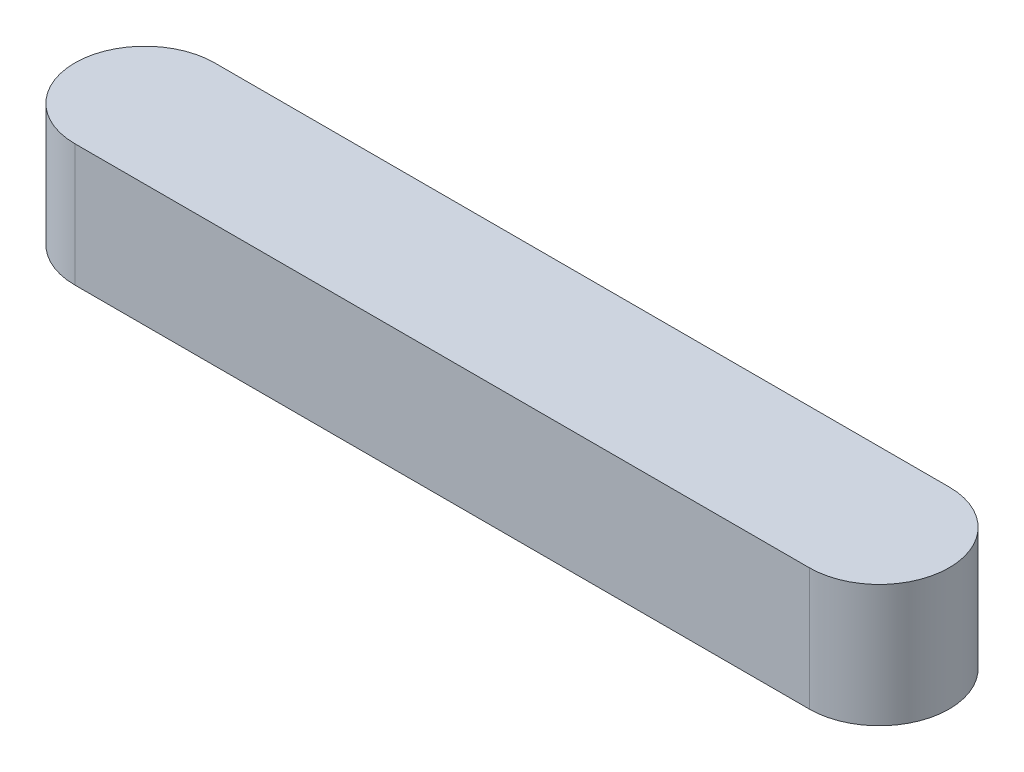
from build123d import *

# Parameters (mm, degrees)
EXTRUDE1_DEPTH = 7


with BuildPart() as part:
    # Sketch1 → Extrude1 (new body)
    with BuildSketch(Plane(origin=(0, 0, 0), x_dir=(1, 0, 0), z_dir=(0, 1, 0))):
        with BuildLine():
            Line((42, 4), (0, 4))
            ThreePointArc((0, 4), (-4, 0), (0, -4))
            Line((0, -4), (42, -4))
            ThreePointArc((42, -4), (46, 0), (42, 4))
        make_face()
    extrude(amount=EXTRUDE1_DEPTH)


solid = part.part
